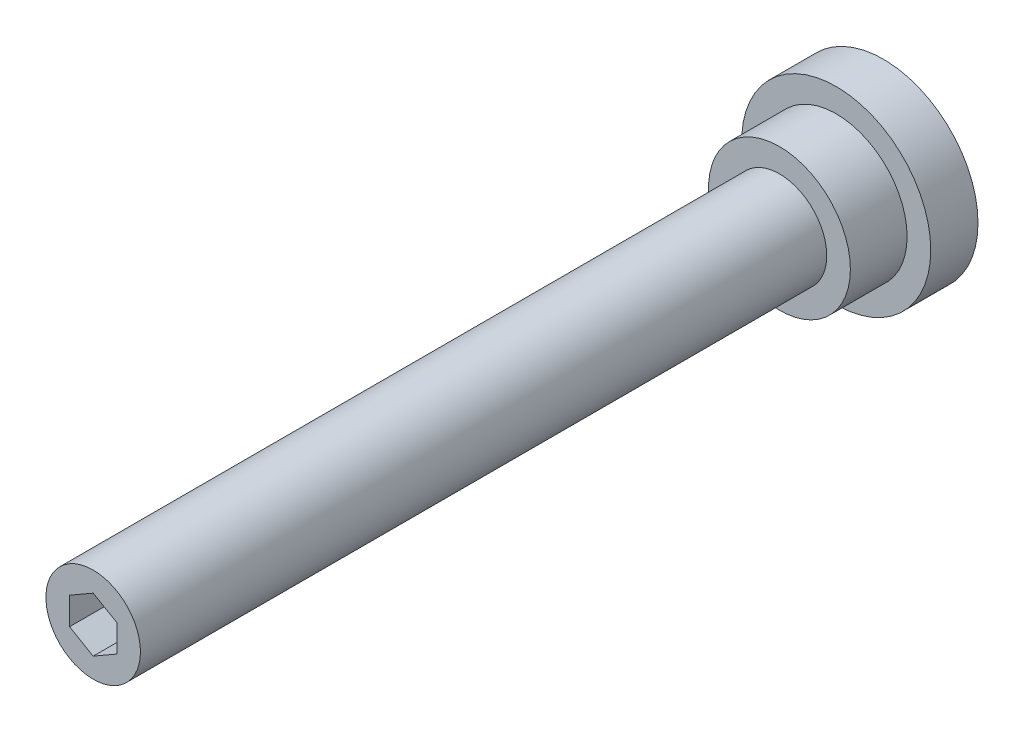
ISO-10303-21;
HEADER;
FILE_DESCRIPTION(('STEP AP214'),'2;1');
FILE_NAME('part.step','',(''),(''),'','','');
FILE_SCHEMA(('AUTOMOTIVE_DESIGN { 1 0 10303 214 1 1 1 1 }'));
ENDSEC;
DATA;
#1=APPLICATION_CONTEXT('core data for automotive mechanical design processes');
#2=APPLICATION_PROTOCOL_DEFINITION('international standard','automotive_design',2000,#1);
#3=PRODUCT_CONTEXT('',#1,'mechanical');
#4=PRODUCT('Part','Part','',(#3));
#5=PRODUCT_RELATED_PRODUCT_CATEGORY('part','',(#4));
#6=PRODUCT_DEFINITION_FORMATION('','',#4);
#7=PRODUCT_DEFINITION_CONTEXT('part definition',#1,'design');
#8=PRODUCT_DEFINITION('design','',#6,#7);
#9=PRODUCT_DEFINITION_SHAPE('','',#8);
#10=(LENGTH_UNIT() NAMED_UNIT(*) SI_UNIT(.MILLI.,.METRE.));
#11=(NAMED_UNIT(*) PLANE_ANGLE_UNIT() SI_UNIT($,.RADIAN.));
#12=(NAMED_UNIT(*) SI_UNIT($,.STERADIAN.) SOLID_ANGLE_UNIT());
#13=UNCERTAINTY_MEASURE_WITH_UNIT(LENGTH_MEASURE(1.E-05),#10,'distance_accuracy_value','');
#14=(GEOMETRIC_REPRESENTATION_CONTEXT(3) GLOBAL_UNCERTAINTY_ASSIGNED_CONTEXT((#13)) GLOBAL_UNIT_ASSIGNED_CONTEXT((#10,
#11,#12)) REPRESENTATION_CONTEXT('',''));
#15=CARTESIAN_POINT('',(0.,0.,0.));
#16=DIRECTION('',(0.,0.,1.));
#17=DIRECTION('',(1.,0.,0.));
#18=AXIS2_PLACEMENT_3D('',#15,#16,#17);
#19=CARTESIAN_POINT('',(0.,0.,83.6));
#20=DIRECTION('',(0.,0.,1.));
#21=DIRECTION('',(1.,0.,0.));
#22=AXIS2_PLACEMENT_3D('',#19,#20,#21);
#23=PLANE('',#22);
#24=DIRECTION('',(-0.866025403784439,0.5,0.));
#25=VECTOR('',#24,1.);
#26=CARTESIAN_POINT('',(2.5,1.44337567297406,83.6));
#27=LINE('',#26,#25);
#28=CARTESIAN_POINT('',(2.5,1.44337567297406,83.6));
#29=VERTEX_POINT('',#28);
#30=CARTESIAN_POINT('',(0.,2.88675134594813,83.6));
#31=VERTEX_POINT('',#30);
#32=EDGE_CURVE('E28',#29,#31,#27,.T.);
#33=ORIENTED_EDGE('',*,*,#32,.F.);
#34=DIRECTION('',(0.,1.,0.));
#35=VECTOR('',#34,1.);
#36=CARTESIAN_POINT('',(2.5,-1.44337567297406,83.6));
#37=LINE('',#36,#35);
#38=CARTESIAN_POINT('',(2.5,-1.44337567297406,83.6));
#39=VERTEX_POINT('',#38);
#40=EDGE_CURVE('E97',#39,#29,#37,.T.);
#41=ORIENTED_EDGE('',*,*,#40,.F.);
#42=DIRECTION('',(0.866025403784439,0.5,0.));
#43=VECTOR('',#42,1.);
#44=CARTESIAN_POINT('',(0.,-2.88675134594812,83.6));
#45=LINE('',#44,#43);
#46=CARTESIAN_POINT('',(0.,-2.88675134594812,83.6));
#47=VERTEX_POINT('',#46);
#48=EDGE_CURVE('E91',#47,#39,#45,.T.);
#49=ORIENTED_EDGE('',*,*,#48,.F.);
#50=DIRECTION('',(0.866025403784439,-0.5,0.));
#51=VECTOR('',#50,1.);
#52=CARTESIAN_POINT('',(-2.5,-1.44337567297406,83.6));
#53=LINE('',#52,#51);
#54=CARTESIAN_POINT('',(-2.5,-1.44337567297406,83.6));
#55=VERTEX_POINT('',#54);
#56=EDGE_CURVE('E89',#55,#47,#53,.T.);
#57=ORIENTED_EDGE('',*,*,#56,.F.);
#58=DIRECTION('',(0.,-1.,0.));
#59=VECTOR('',#58,1.);
#60=CARTESIAN_POINT('',(-2.5,1.44337567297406,83.6));
#61=LINE('',#60,#59);
#62=CARTESIAN_POINT('',(-2.5,1.44337567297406,83.6));
#63=VERTEX_POINT('',#62);
#64=EDGE_CURVE('E71',#63,#55,#61,.T.);
#65=ORIENTED_EDGE('',*,*,#64,.F.);
#66=DIRECTION('',(-0.866025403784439,-0.5,0.));
#67=VECTOR('',#66,1.);
#68=CARTESIAN_POINT('',(0.,2.88675134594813,83.6));
#69=LINE('',#68,#67);
#70=EDGE_CURVE('E82',#31,#63,#69,.T.);
#71=ORIENTED_EDGE('',*,*,#70,.F.);
#72=EDGE_LOOP('',(#33,#41,#49,#57,#65,#71));
#73=FACE_BOUND('',#72,.T.);
#74=CARTESIAN_POINT('',(0.,0.,83.6));
#75=DIRECTION('',(0.,0.,1.));
#76=DIRECTION('',(1.,0.,0.));
#77=AXIS2_PLACEMENT_3D('',#74,#75,#76);
#78=CIRCLE('',#77,5.);
#79=CARTESIAN_POINT('',(5.,0.,83.6));
#80=VERTEX_POINT('',#79);
#81=EDGE_CURVE('E9',#80,#80,#78,.T.);
#82=ORIENTED_EDGE('',*,*,#81,.T.);
#83=EDGE_LOOP('',(#82));
#84=FACE_BOUND('',#83,.T.);
#85=ADVANCED_FACE('F14',(#73,#84),#23,.T.);
#86=CARTESIAN_POINT('',(0.,0.,30.));
#87=DIRECTION('',(0.,0.,1.));
#88=DIRECTION('',(1.,0.,0.));
#89=AXIS2_PLACEMENT_3D('',#86,#87,#88);
#90=CYLINDRICAL_SURFACE('',#89,5.);
#91=CARTESIAN_POINT('',(0.,0.,11.));
#92=DIRECTION('',(0.,0.,1.));
#93=DIRECTION('',(1.,0.,0.));
#94=AXIS2_PLACEMENT_3D('',#91,#92,#93);
#95=CIRCLE('',#94,5.);
#96=CARTESIAN_POINT('',(5.,0.,11.));
#97=VERTEX_POINT('',#96);
#98=EDGE_CURVE('E21',#97,#97,#95,.T.);
#99=ORIENTED_EDGE('',*,*,#98,.T.);
#100=EDGE_LOOP('',(#99));
#101=FACE_BOUND('',#100,.T.);
#102=ORIENTED_EDGE('',*,*,#81,.F.);
#103=EDGE_LOOP('',(#102));
#104=FACE_BOUND('',#103,.T.);
#105=ADVANCED_FACE('F135',(#101,#104),#90,.T.);
#106=CARTESIAN_POINT('',(-5.,0.,11.));
#107=DIRECTION('',(0.,0.,1.));
#108=DIRECTION('',(1.,0.,0.));
#109=AXIS2_PLACEMENT_3D('',#106,#107,#108);
#110=PLANE('',#109);
#111=CARTESIAN_POINT('',(0.,0.,11.));
#112=DIRECTION('',(0.,0.,1.));
#113=DIRECTION('',(1.,0.,0.));
#114=AXIS2_PLACEMENT_3D('',#111,#112,#113);
#115=CIRCLE('',#114,7.5);
#116=CARTESIAN_POINT('',(7.5,0.,11.));
#117=VERTEX_POINT('',#116);
#118=EDGE_CURVE('E130',#117,#117,#115,.T.);
#119=ORIENTED_EDGE('',*,*,#118,.T.);
#120=EDGE_LOOP('',(#119));
#121=FACE_BOUND('',#120,.T.);
#122=ORIENTED_EDGE('',*,*,#98,.F.);
#123=EDGE_LOOP('',(#122));
#124=FACE_BOUND('',#123,.T.);
#125=ADVANCED_FACE('F138',(#121,#124),#110,.T.);
#126=CARTESIAN_POINT('',(0.,0.,30.));
#127=DIRECTION('',(0.,0.,1.));
#128=DIRECTION('',(1.,0.,0.));
#129=AXIS2_PLACEMENT_3D('',#126,#127,#128);
#130=CYLINDRICAL_SURFACE('',#129,7.5);
#131=CARTESIAN_POINT('',(0.,0.,5.));
#132=DIRECTION('',(0.,0.,1.));
#133=DIRECTION('',(1.,0.,0.));
#134=AXIS2_PLACEMENT_3D('',#131,#132,#133);
#135=CIRCLE('',#134,7.5);
#136=CARTESIAN_POINT('',(7.5,0.,5.));
#137=VERTEX_POINT('',#136);
#138=EDGE_CURVE('E127',#137,#137,#135,.T.);
#139=ORIENTED_EDGE('',*,*,#138,.T.);
#140=EDGE_LOOP('',(#139));
#141=FACE_BOUND('',#140,.T.);
#142=ORIENTED_EDGE('',*,*,#118,.F.);
#143=EDGE_LOOP('',(#142));
#144=FACE_BOUND('',#143,.T.);
#145=ADVANCED_FACE('F140',(#141,#144),#130,.T.);
#146=CARTESIAN_POINT('',(-7.5,0.,5.));
#147=DIRECTION('',(0.,0.,1.));
#148=DIRECTION('',(1.,0.,0.));
#149=AXIS2_PLACEMENT_3D('',#146,#147,#148);
#150=PLANE('',#149);
#151=CARTESIAN_POINT('',(0.,0.,5.));
#152=DIRECTION('',(0.,0.,1.));
#153=DIRECTION('',(1.,0.,0.));
#154=AXIS2_PLACEMENT_3D('',#151,#152,#153);
#155=CIRCLE('',#154,10.);
#156=CARTESIAN_POINT('',(10.,0.,5.));
#157=VERTEX_POINT('',#156);
#158=EDGE_CURVE('E124',#157,#157,#155,.T.);
#159=ORIENTED_EDGE('',*,*,#158,.T.);
#160=EDGE_LOOP('',(#159));
#161=FACE_BOUND('',#160,.T.);
#162=ORIENTED_EDGE('',*,*,#138,.F.);
#163=EDGE_LOOP('',(#162));
#164=FACE_BOUND('',#163,.T.);
#165=ADVANCED_FACE('F148',(#161,#164),#150,.T.);
#166=CARTESIAN_POINT('',(0.,0.,30.));
#167=DIRECTION('',(0.,0.,1.));
#168=DIRECTION('',(1.,0.,0.));
#169=AXIS2_PLACEMENT_3D('',#166,#167,#168);
#170=CYLINDRICAL_SURFACE('',#169,10.);
#171=CARTESIAN_POINT('',(0.,0.,0.));
#172=DIRECTION('',(0.,0.,1.));
#173=DIRECTION('',(1.,0.,0.));
#174=AXIS2_PLACEMENT_3D('',#171,#172,#173);
#175=CIRCLE('',#174,10.);
#176=CARTESIAN_POINT('',(10.,0.,0.));
#177=VERTEX_POINT('',#176);
#178=EDGE_CURVE('E115',#177,#177,#175,.T.);
#179=ORIENTED_EDGE('',*,*,#178,.T.);
#180=EDGE_LOOP('',(#179));
#181=FACE_BOUND('',#180,.T.);
#182=ORIENTED_EDGE('',*,*,#158,.F.);
#183=EDGE_LOOP('',(#182));
#184=FACE_BOUND('',#183,.T.);
#185=ADVANCED_FACE('F184',(#181,#184),#170,.T.);
#186=CARTESIAN_POINT('',(-10.,0.,0.));
#187=DIRECTION('',(0.,0.,-1.));
#188=DIRECTION('',(-1.,0.,0.));
#189=AXIS2_PLACEMENT_3D('',#186,#187,#188);
#190=PLANE('',#189);
#191=ORIENTED_EDGE('',*,*,#178,.F.);
#192=EDGE_LOOP('',(#191));
#193=FACE_BOUND('',#192,.T.);
#194=ADVANCED_FACE('F194',(#193),#190,.T.);
#195=CARTESIAN_POINT('',(2.5,1.44337567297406,79.6));
#196=DIRECTION('',(0.5,0.866025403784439,0.));
#197=DIRECTION('',(-0.866025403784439,0.5,0.));
#198=AXIS2_PLACEMENT_3D('',#195,#196,#197);
#199=PLANE('',#198);
#200=ORIENTED_EDGE('',*,*,#32,.T.);
#201=DIRECTION('',(0.,0.,1.));
#202=VECTOR('',#201,1.);
#203=CARTESIAN_POINT('',(0.,2.88675134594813,79.6));
#204=LINE('',#203,#202);
#205=CARTESIAN_POINT('',(0.,2.88675134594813,79.6));
#206=VERTEX_POINT('',#205);
#207=EDGE_CURVE('E79',#206,#31,#204,.T.);
#208=ORIENTED_EDGE('',*,*,#207,.F.);
#209=DIRECTION('',(-0.866025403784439,0.5,0.));
#210=VECTOR('',#209,1.);
#211=CARTESIAN_POINT('',(2.5,1.44337567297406,79.6));
#212=LINE('',#211,#210);
#213=CARTESIAN_POINT('',(2.5,1.44337567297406,79.6));
#214=VERTEX_POINT('',#213);
#215=EDGE_CURVE('E99',#214,#206,#212,.T.);
#216=ORIENTED_EDGE('',*,*,#215,.F.);
#217=DIRECTION('',(0.,0.,1.));
#218=VECTOR('',#217,1.);
#219=CARTESIAN_POINT('',(2.5,1.44337567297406,79.6));
#220=LINE('',#219,#218);
#221=EDGE_CURVE('E35',#214,#29,#220,.T.);
#222=ORIENTED_EDGE('',*,*,#221,.T.);
#223=EDGE_LOOP('',(#200,#208,#216,#222));
#224=FACE_BOUND('',#223,.T.);
#225=ADVANCED_FACE('F204',(#224),#199,.F.);
#226=CARTESIAN_POINT('',(2.5,-1.44337567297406,79.6));
#227=DIRECTION('',(1.,0.,0.));
#228=DIRECTION('',(0.,1.,0.));
#229=AXIS2_PLACEMENT_3D('',#226,#227,#228);
#230=PLANE('',#229);
#231=ORIENTED_EDGE('',*,*,#40,.T.);
#232=ORIENTED_EDGE('',*,*,#221,.F.);
#233=DIRECTION('',(0.,1.,0.));
#234=VECTOR('',#233,1.);
#235=CARTESIAN_POINT('',(2.5,-1.44337567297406,79.6));
#236=LINE('',#235,#234);
#237=CARTESIAN_POINT('',(2.5,-1.44337567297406,79.6));
#238=VERTEX_POINT('',#237);
#239=EDGE_CURVE('E111',#238,#214,#236,.T.);
#240=ORIENTED_EDGE('',*,*,#239,.F.);
#241=DIRECTION('',(0.,0.,1.));
#242=VECTOR('',#241,1.);
#243=CARTESIAN_POINT('',(2.5,-1.44337567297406,79.6));
#244=LINE('',#243,#242);
#245=EDGE_CURVE('E116',#238,#39,#244,.T.);
#246=ORIENTED_EDGE('',*,*,#245,.T.);
#247=EDGE_LOOP('',(#231,#232,#240,#246));
#248=FACE_BOUND('',#247,.T.);
#249=ADVANCED_FACE('F214',(#248),#230,.F.);
#250=CARTESIAN_POINT('',(0.,-2.88675134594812,79.6));
#251=DIRECTION('',(0.5,-0.866025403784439,0.));
#252=DIRECTION('',(0.866025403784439,0.5,0.));
#253=AXIS2_PLACEMENT_3D('',#250,#251,#252);
#254=PLANE('',#253);
#255=ORIENTED_EDGE('',*,*,#48,.T.);
#256=ORIENTED_EDGE('',*,*,#245,.F.);
#257=DIRECTION('',(0.866025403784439,0.5,0.));
#258=VECTOR('',#257,1.);
#259=CARTESIAN_POINT('',(0.,-2.88675134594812,79.6));
#260=LINE('',#259,#258);
#261=CARTESIAN_POINT('',(0.,-2.88675134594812,79.6));
#262=VERTEX_POINT('',#261);
#263=EDGE_CURVE('E108',#262,#238,#260,.T.);
#264=ORIENTED_EDGE('',*,*,#263,.F.);
#265=DIRECTION('',(0.,0.,1.));
#266=VECTOR('',#265,1.);
#267=CARTESIAN_POINT('',(0.,-2.88675134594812,79.6));
#268=LINE('',#267,#266);
#269=EDGE_CURVE('E118',#262,#47,#268,.T.);
#270=ORIENTED_EDGE('',*,*,#269,.T.);
#271=EDGE_LOOP('',(#255,#256,#264,#270));
#272=FACE_BOUND('',#271,.T.);
#273=ADVANCED_FACE('F223',(#272),#254,.F.);
#274=CARTESIAN_POINT('',(-2.5,-1.44337567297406,79.6));
#275=DIRECTION('',(-0.5,-0.866025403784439,0.));
#276=DIRECTION('',(0.866025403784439,-0.5,0.));
#277=AXIS2_PLACEMENT_3D('',#274,#275,#276);
#278=PLANE('',#277);
#279=ORIENTED_EDGE('',*,*,#56,.T.);
#280=ORIENTED_EDGE('',*,*,#269,.F.);
#281=DIRECTION('',(0.866025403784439,-0.5,0.));
#282=VECTOR('',#281,1.);
#283=CARTESIAN_POINT('',(-2.5,-1.44337567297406,79.6));
#284=LINE('',#283,#282);
#285=CARTESIAN_POINT('',(-2.5,-1.44337567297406,79.6));
#286=VERTEX_POINT('',#285);
#287=EDGE_CURVE('E105',#286,#262,#284,.T.);
#288=ORIENTED_EDGE('',*,*,#287,.F.);
#289=DIRECTION('',(0.,0.,1.));
#290=VECTOR('',#289,1.);
#291=CARTESIAN_POINT('',(-2.5,-1.44337567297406,79.6));
#292=LINE('',#291,#290);
#293=EDGE_CURVE('E78',#286,#55,#292,.T.);
#294=ORIENTED_EDGE('',*,*,#293,.T.);
#295=EDGE_LOOP('',(#279,#280,#288,#294));
#296=FACE_BOUND('',#295,.T.);
#297=ADVANCED_FACE('F232',(#296),#278,.F.);
#298=CARTESIAN_POINT('',(-2.5,1.44337567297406,79.6));
#299=DIRECTION('',(-1.,0.,0.));
#300=DIRECTION('',(0.,0.,1.));
#301=AXIS2_PLACEMENT_3D('',#298,#299,#300);
#302=PLANE('',#301);
#303=ORIENTED_EDGE('',*,*,#64,.T.);
#304=ORIENTED_EDGE('',*,*,#293,.F.);
#305=DIRECTION('',(0.,-1.,0.));
#306=VECTOR('',#305,1.);
#307=CARTESIAN_POINT('',(-2.5,1.44337567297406,79.6));
#308=LINE('',#307,#306);
#309=CARTESIAN_POINT('',(-2.5,1.44337567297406,79.6));
#310=VERTEX_POINT('',#309);
#311=EDGE_CURVE('E74',#310,#286,#308,.T.);
#312=ORIENTED_EDGE('',*,*,#311,.F.);
#313=DIRECTION('',(0.,0.,1.));
#314=VECTOR('',#313,1.);
#315=CARTESIAN_POINT('',(-2.5,1.44337567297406,79.6));
#316=LINE('',#315,#314);
#317=EDGE_CURVE('E67',#310,#63,#316,.T.);
#318=ORIENTED_EDGE('',*,*,#317,.T.);
#319=EDGE_LOOP('',(#303,#304,#312,#318));
#320=FACE_BOUND('',#319,.T.);
#321=ADVANCED_FACE('F69',(#320),#302,.F.);
#322=CARTESIAN_POINT('',(0.,2.88675134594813,79.6));
#323=DIRECTION('',(-0.5,0.866025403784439,0.));
#324=DIRECTION('',(-0.866025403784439,-0.5,0.));
#325=AXIS2_PLACEMENT_3D('',#322,#323,#324);
#326=PLANE('',#325);
#327=ORIENTED_EDGE('',*,*,#70,.T.);
#328=ORIENTED_EDGE('',*,*,#317,.F.);
#329=DIRECTION('',(-0.866025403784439,-0.5,0.));
#330=VECTOR('',#329,1.);
#331=CARTESIAN_POINT('',(0.,2.88675134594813,79.6));
#332=LINE('',#331,#330);
#333=EDGE_CURVE('E102',#206,#310,#332,.T.);
#334=ORIENTED_EDGE('',*,*,#333,.F.);
#335=ORIENTED_EDGE('',*,*,#207,.T.);
#336=EDGE_LOOP('',(#327,#328,#334,#335));
#337=FACE_BOUND('',#336,.T.);
#338=ADVANCED_FACE('F83',(#337),#326,.F.);
#339=CARTESIAN_POINT('',(2.5,1.44337567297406,79.6));
#340=DIRECTION('',(0.,0.,-1.));
#341=DIRECTION('',(-1.,0.,0.));
#342=AXIS2_PLACEMENT_3D('',#339,#340,#341);
#343=PLANE('',#342);
#344=ORIENTED_EDGE('',*,*,#215,.T.);
#345=ORIENTED_EDGE('',*,*,#333,.T.);
#346=ORIENTED_EDGE('',*,*,#311,.T.);
#347=ORIENTED_EDGE('',*,*,#287,.T.);
#348=ORIENTED_EDGE('',*,*,#263,.T.);
#349=ORIENTED_EDGE('',*,*,#239,.T.);
#350=EDGE_LOOP('',(#344,#345,#346,#347,#348,#349));
#351=FACE_BOUND('',#350,.T.);
#352=ADVANCED_FACE('F259',(#351),#343,.F.);
#353=CLOSED_SHELL('',(#85,#105,#125,#145,#165,#185,#194,#225,#249,#273,#297,#321,#338,#352));
#354=MANIFOLD_SOLID_BREP('B1',#353);
#355=ADVANCED_BREP_SHAPE_REPRESENTATION('',(#18,#354),#14);
#356=SHAPE_DEFINITION_REPRESENTATION(#9,#355);
ENDSEC;
END-ISO-10303-21;
